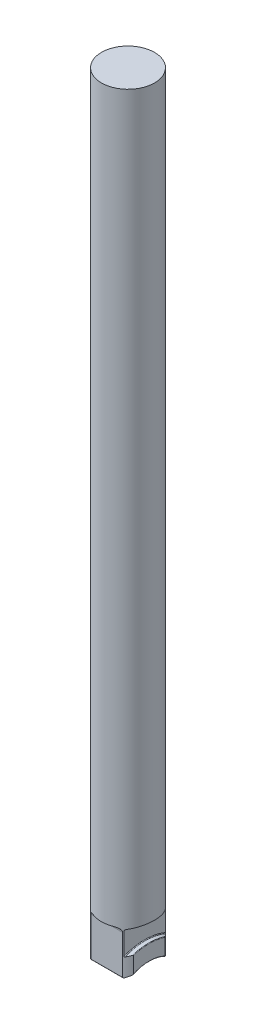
from build123d import *

# Parameters (mm, degrees)
SKETCH1_W               = 31.75
SKETCH1_H               = 479.425
BOSS_EXTRUDE1_DEPTH     = 15.875
CUT_EXTRUDE4_DEPTH      = 480.950374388
CUT_EXTRUDE4_DEPTH_BACK = 480.950374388
SKETCH8_R               = 22.225
SKETCH2_W               = 5.969
SKETCH2_H               = 13.462
CUT_EXTRUDE2_DEPTH      = 480.950374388
CUT_EXTRUDE2_DEPTH_BACK = 480.950374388
CUT_EXTRUDE3_DEPTH      = 480.950374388
CUT_EXTRUDE3_DEPTH_BACK = 480.950374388
SKETCH7_W               = 3.175
SKETCH7_H               = 31.75
FILLET1_R               = 0.762
FILLET2_R               = 0.381
FILLET3_R               = 0.254
SKETCH9_OUTSIDE_W       = 126.378
SKETCH9_OUTSIDE_H       = 126.378
SKETCH9_OUTSIDE_R       = 15.875
CUT_EXTRUDE5_DEPTH      = 462.50635352


with BuildPart() as part:
    # Sketch1 → Boss-Extrude1 (new, symmetric)
    with BuildSketch(Plane(origin=(0, 0, 0), x_dir=(0, 0, -1), z_dir=(1, 0, 0))):
        with Locations((0, 239.7125)):
            Rectangle(SKETCH1_W, SKETCH1_H)
    extrude(amount=BOSS_EXTRUDE1_DEPTH, both=True)

    # Sketch8 → Cut-Extrude4 (cut, two sides: drawn at the far end of the back side and taken through both)
    with BuildSketch(Plane(origin=(0, 0, 0), x_dir=(0, 0, -1), z_dir=(1, 0, 0)).offset(-CUT_EXTRUDE4_DEPTH_BACK)):
        Circle(SKETCH8_R)
    extrude(amount=CUT_EXTRUDE4_DEPTH + CUT_EXTRUDE4_DEPTH_BACK, mode=Mode.SUBTRACT)

    # Sketch2 → Cut-Revolve1 (revolve, cut)
    with BuildSketch(Plane.XY):
        with Locations((12.8905, 38.481)):
            Rectangle(SKETCH2_W, SKETCH2_H)
        with Locations((-12.8905, 38.481)):
            Rectangle(SKETCH2_W, SKETCH2_H)
    revolve(axis=Axis((-8.84822894, 0, 0), (1, 0, 0)), mode=Mode.SUBTRACT)

    # Sketch6 → Cut-Extrude2 (cut, two sides: drawn at the far end of the back side and taken through both)
    with BuildSketch(Plane(origin=(0, 0, 0), x_dir=(0, 0, -1), z_dir=(1, 0, 0)).offset(-CUT_EXTRUDE2_DEPTH_BACK)):
        with BuildLine():
            Line((12.7, 0), (31.75, 0))
            Line((31.75, 0), (31.75, 44.4246))
            Line((31.75, 44.4246), (15.0876, 44.4246))
            ThreePointArc((15.0876, 44.4246), (13.399311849, 43.725288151), (12.7, 42.037))
            Line((12.7, 42.037), (12.7, 0))
        make_face()
        with BuildLine():
            Line((-12.7, 0), (-31.75, 0))
            Line((-31.75, 0), (-31.75, 44.4246))
            Line((-31.75, 44.4246), (-15.0876, 44.4246))
            ThreePointArc((-15.0876, 44.4246), (-13.399311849, 43.725288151), (-12.7, 42.037))
            Line((-12.7, 42.037), (-12.7, 0))
        make_face()
    extrude(amount=CUT_EXTRUDE2_DEPTH + CUT_EXTRUDE2_DEPTH_BACK, mode=Mode.SUBTRACT)

    # Sketch7 → Cut-Extrude3 (cut, two sides: drawn at the far end of the back side and taken through both)
    with BuildSketch(Plane.XY.offset(-CUT_EXTRUDE3_DEPTH_BACK)):
        with Locations((-14.2875, 15.875)):
            Rectangle(SKETCH7_W, SKETCH7_H)
        with Locations((14.2875, 15.875)):
            Rectangle(SKETCH7_W, SKETCH7_H)
    extrude(amount=CUT_EXTRUDE3_DEPTH + CUT_EXTRUDE3_DEPTH_BACK, mode=Mode.SUBTRACT)

    # Fillet1
    fillet1_edges = [part.edges().sort_by_distance(p)[0] for p in [
        (9.906, 45.212, 0),
        (-9.906, 45.212, 0),
    ]]
    fillet(fillet1_edges, radius=FILLET1_R)

    # Fillet2
    fillet2_edges = [part.edges().sort_by_distance(p)[0] for p in [
        (9.906, 31.75, 0),
        (-9.906, 31.75, 0),
    ]]
    fillet(fillet2_edges, radius=FILLET2_R)

    # Fillet3
    fillet3_edges = [part.edges().sort_by_distance(p)[0] for p in [
        (0, 18.238986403, -12.7),
        (12.7, 23.669171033, -12.7),
        (-12.7, 23.669171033, -12.7),
        (0, 18.238986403, 12.7),
        (-12.7, 31.75, 0),
        (-12.7, 23.669171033, 12.7),
        (-12.7, 22.225, 0),
        (12.7, 31.75, 0),
        (12.7, 22.225, 0),
        (12.7, 23.669171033, 12.7),
    ]]
    fillet(fillet3_edges, radius=FILLET3_R)

    # Sketch9 outside → Cut-Extrude5 (cut, through all)
    with BuildSketch(Plane(origin=(0, 479.425, 0), x_dir=(1, 0, 0), z_dir=(0, 1, 0))):
        Rectangle(SKETCH9_OUTSIDE_W, SKETCH9_OUTSIDE_H)
        with Locations(Location((0, 0, 0), (0, 0, 270))):
            Circle(SKETCH9_OUTSIDE_R, mode=Mode.SUBTRACT)
    extrude(amount=-CUT_EXTRUDE5_DEPTH, mode=Mode.SUBTRACT)


solid = part.part
